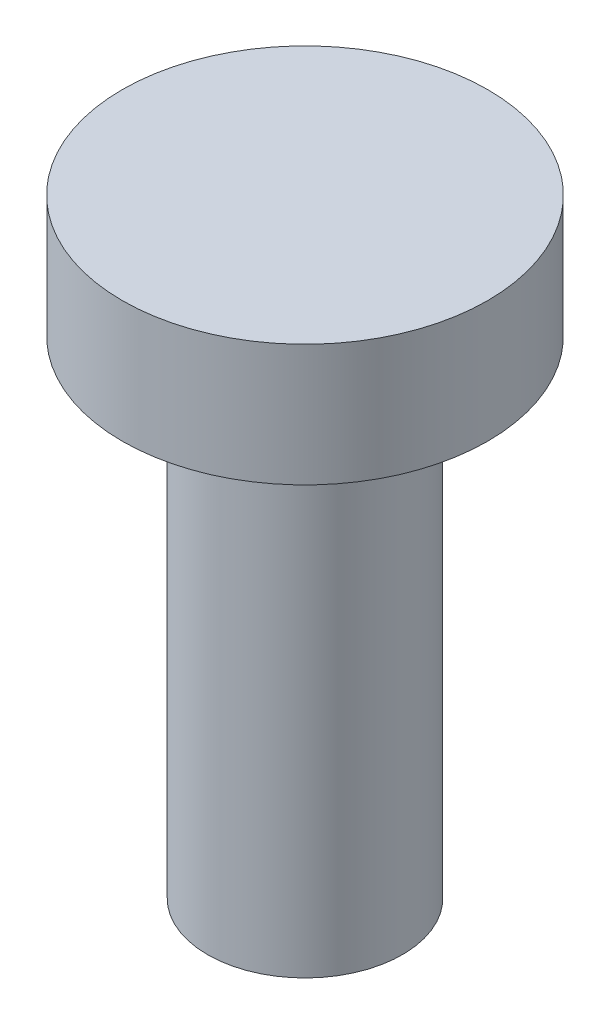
ISO-10303-21;
HEADER;
FILE_DESCRIPTION(('STEP AP214'),'2;1');
FILE_NAME('part.step','',(''),(''),'','','');
FILE_SCHEMA(('AUTOMOTIVE_DESIGN { 1 0 10303 214 1 1 1 1 }'));
ENDSEC;
DATA;
#1=APPLICATION_CONTEXT('core data for automotive mechanical design processes');
#2=APPLICATION_PROTOCOL_DEFINITION('international standard','automotive_design',2000,#1);
#3=PRODUCT_CONTEXT('',#1,'mechanical');
#4=PRODUCT('Part','Part','',(#3));
#5=PRODUCT_RELATED_PRODUCT_CATEGORY('part','',(#4));
#6=PRODUCT_DEFINITION_FORMATION('','',#4);
#7=PRODUCT_DEFINITION_CONTEXT('part definition',#1,'design');
#8=PRODUCT_DEFINITION('design','',#6,#7);
#9=PRODUCT_DEFINITION_SHAPE('','',#8);
#10=(LENGTH_UNIT() NAMED_UNIT(*) SI_UNIT(.MILLI.,.METRE.));
#11=(NAMED_UNIT(*) PLANE_ANGLE_UNIT() SI_UNIT($,.RADIAN.));
#12=(NAMED_UNIT(*) SI_UNIT($,.STERADIAN.) SOLID_ANGLE_UNIT());
#13=UNCERTAINTY_MEASURE_WITH_UNIT(LENGTH_MEASURE(1.E-05),#10,'distance_accuracy_value','');
#14=(GEOMETRIC_REPRESENTATION_CONTEXT(3) GLOBAL_UNCERTAINTY_ASSIGNED_CONTEXT((#13)) GLOBAL_UNIT_ASSIGNED_CONTEXT((#10,
#11,#12)) REPRESENTATION_CONTEXT('',''));
#15=CARTESIAN_POINT('',(0.,0.,0.));
#16=DIRECTION('',(0.,0.,1.));
#17=DIRECTION('',(1.,0.,0.));
#18=AXIS2_PLACEMENT_3D('',#15,#16,#17);
#19=CARTESIAN_POINT('',(0.,25.4,0.));
#20=DIRECTION('',(0.,-1.,0.));
#21=DIRECTION('',(0.,0.,-1.));
#22=AXIS2_PLACEMENT_3D('',#19,#20,#21);
#23=CYLINDRICAL_SURFACE('',#22,5.08);
#24=CARTESIAN_POINT('',(0.,25.4,0.));
#25=DIRECTION('',(0.,1.,0.));
#26=DIRECTION('',(0.,0.,1.));
#27=AXIS2_PLACEMENT_3D('',#24,#25,#26);
#28=CIRCLE('',#27,5.08);
#29=CARTESIAN_POINT('',(0.,25.4,5.08));
#30=VERTEX_POINT('',#29);
#31=EDGE_CURVE('E10',#30,#30,#28,.T.);
#32=ORIENTED_EDGE('',*,*,#31,.F.);
#33=EDGE_LOOP('',(#32));
#34=FACE_BOUND('',#33,.T.);
#35=CARTESIAN_POINT('',(0.,0.,0.));
#36=DIRECTION('',(0.,1.,0.));
#37=DIRECTION('',(0.,0.,1.));
#38=AXIS2_PLACEMENT_3D('',#35,#36,#37);
#39=CIRCLE('',#38,5.08);
#40=CARTESIAN_POINT('',(0.,0.,5.08));
#41=VERTEX_POINT('',#40);
#42=EDGE_CURVE('E32',#41,#41,#39,.T.);
#43=ORIENTED_EDGE('',*,*,#42,.T.);
#44=EDGE_LOOP('',(#43));
#45=FACE_BOUND('',#44,.T.);
#46=ADVANCED_FACE('F26',(#34,#45),#23,.T.);
#47=CARTESIAN_POINT('',(0.,0.,0.));
#48=DIRECTION('',(0.,1.,0.));
#49=DIRECTION('',(0.,0.,1.));
#50=AXIS2_PLACEMENT_3D('',#47,#48,#49);
#51=PLANE('',#50);
#52=CARTESIAN_POINT('',(0.,0.,0.));
#53=DIRECTION('',(0.,-1.,0.));
#54=DIRECTION('',(0.,0.,-1.));
#55=AXIS2_PLACEMENT_3D('',#52,#53,#54);
#56=CIRCLE('',#55,2.286);
#57=CARTESIAN_POINT('',(0.,0.,-2.286));
#58=VERTEX_POINT('',#57);
#59=EDGE_CURVE('E48',#58,#58,#56,.T.);
#60=ORIENTED_EDGE('',*,*,#59,.F.);
#61=EDGE_LOOP('',(#60));
#62=FACE_BOUND('',#61,.T.);
#63=ORIENTED_EDGE('',*,*,#42,.F.);
#64=EDGE_LOOP('',(#63));
#65=FACE_BOUND('',#64,.T.);
#66=ADVANCED_FACE('F54',(#62,#65),#51,.F.);
#67=CARTESIAN_POINT('',(0.,25.4,0.));
#68=DIRECTION('',(0.,1.,0.));
#69=DIRECTION('',(0.,0.,1.));
#70=AXIS2_PLACEMENT_3D('',#67,#68,#69);
#71=PLANE('',#70);
#72=CARTESIAN_POINT('',(0.,25.4,0.));
#73=DIRECTION('',(0.,1.,0.));
#74=DIRECTION('',(0.,0.,1.));
#75=AXIS2_PLACEMENT_3D('',#72,#73,#74);
#76=CIRCLE('',#75,9.525);
#77=CARTESIAN_POINT('',(0.,25.4,9.525));
#78=VERTEX_POINT('',#77);
#79=EDGE_CURVE('E40',#78,#78,#76,.T.);
#80=ORIENTED_EDGE('',*,*,#79,.F.);
#81=EDGE_LOOP('',(#80));
#82=FACE_BOUND('',#81,.T.);
#83=ORIENTED_EDGE('',*,*,#31,.T.);
#84=EDGE_LOOP('',(#83));
#85=FACE_BOUND('',#84,.T.);
#86=ADVANCED_FACE('F57',(#82,#85),#71,.F.);
#87=CARTESIAN_POINT('',(0.,31.75,0.));
#88=DIRECTION('',(0.,-1.,0.));
#89=DIRECTION('',(0.,0.,-1.));
#90=AXIS2_PLACEMENT_3D('',#87,#88,#89);
#91=CYLINDRICAL_SURFACE('',#90,9.525);
#92=CARTESIAN_POINT('',(0.,31.75,0.));
#93=DIRECTION('',(0.,1.,0.));
#94=DIRECTION('',(0.,0.,1.));
#95=AXIS2_PLACEMENT_3D('',#92,#93,#94);
#96=CIRCLE('',#95,9.525);
#97=CARTESIAN_POINT('',(0.,31.75,9.525));
#98=VERTEX_POINT('',#97);
#99=EDGE_CURVE('E36',#98,#98,#96,.T.);
#100=ORIENTED_EDGE('',*,*,#99,.F.);
#101=EDGE_LOOP('',(#100));
#102=FACE_BOUND('',#101,.T.);
#103=ORIENTED_EDGE('',*,*,#79,.T.);
#104=EDGE_LOOP('',(#103));
#105=FACE_BOUND('',#104,.T.);
#106=ADVANCED_FACE('F63',(#102,#105),#91,.T.);
#107=CARTESIAN_POINT('',(0.,31.75,0.));
#108=DIRECTION('',(0.,1.,0.));
#109=DIRECTION('',(0.,0.,1.));
#110=AXIS2_PLACEMENT_3D('',#107,#108,#109);
#111=PLANE('',#110);
#112=ORIENTED_EDGE('',*,*,#99,.T.);
#113=EDGE_LOOP('',(#112));
#114=FACE_BOUND('',#113,.T.);
#115=ADVANCED_FACE('F71',(#114),#111,.T.);
#116=CARTESIAN_POINT('',(0.,6.35,0.));
#117=DIRECTION('',(0.,-1.,0.));
#118=DIRECTION('',(0.,0.,-1.));
#119=AXIS2_PLACEMENT_3D('',#116,#117,#118);
#120=CYLINDRICAL_SURFACE('',#119,2.286);
#121=CARTESIAN_POINT('',(0.,6.35,0.));
#122=DIRECTION('',(0.,-1.,0.));
#123=DIRECTION('',(0.,0.,-1.));
#124=AXIS2_PLACEMENT_3D('',#121,#122,#123);
#125=CIRCLE('',#124,2.286);
#126=CARTESIAN_POINT('',(0.,6.35,-2.286));
#127=VERTEX_POINT('',#126);
#128=EDGE_CURVE('E45',#127,#127,#125,.T.);
#129=ORIENTED_EDGE('',*,*,#128,.F.);
#130=EDGE_LOOP('',(#129));
#131=FACE_BOUND('',#130,.T.);
#132=ORIENTED_EDGE('',*,*,#59,.T.);
#133=EDGE_LOOP('',(#132));
#134=FACE_BOUND('',#133,.T.);
#135=ADVANCED_FACE('F52',(#131,#134),#120,.F.);
#136=CARTESIAN_POINT('',(0.,6.35,0.));
#137=DIRECTION('',(0.,-1.,0.));
#138=DIRECTION('',(0.,0.,-1.));
#139=AXIS2_PLACEMENT_3D('',#136,#137,#138);
#140=PLANE('',#139);
#141=ORIENTED_EDGE('',*,*,#128,.T.);
#142=EDGE_LOOP('',(#141));
#143=FACE_BOUND('',#142,.T.);
#144=ADVANCED_FACE('F76',(#143),#140,.T.);
#145=CLOSED_SHELL('',(#46,#66,#86,#106,#115,#135,#144));
#146=MANIFOLD_SOLID_BREP('B2',#145);
#147=ADVANCED_BREP_SHAPE_REPRESENTATION('',(#18,#146),#14);
#148=SHAPE_DEFINITION_REPRESENTATION(#9,#147);
ENDSEC;
END-ISO-10303-21;
